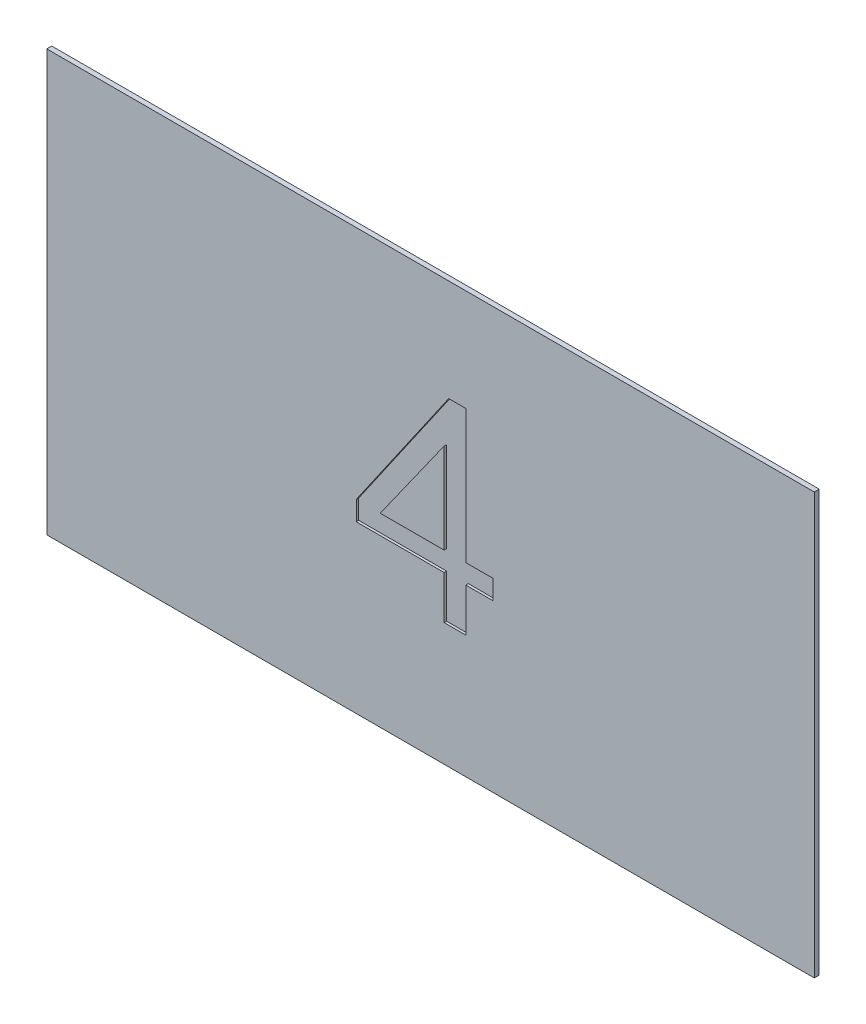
ISO-10303-21;
HEADER;
FILE_DESCRIPTION(('STEP AP214'),'2;1');
FILE_NAME('part.step','',(''),(''),'','','');
FILE_SCHEMA(('AUTOMOTIVE_DESIGN { 1 0 10303 214 1 1 1 1 }'));
ENDSEC;
DATA;
#1=APPLICATION_CONTEXT('core data for automotive mechanical design processes');
#2=APPLICATION_PROTOCOL_DEFINITION('international standard','automotive_design',2000,#1);
#3=PRODUCT_CONTEXT('',#1,'mechanical');
#4=PRODUCT('Part','Part','',(#3));
#5=PRODUCT_RELATED_PRODUCT_CATEGORY('part','',(#4));
#6=PRODUCT_DEFINITION_FORMATION('','',#4);
#7=PRODUCT_DEFINITION_CONTEXT('part definition',#1,'design');
#8=PRODUCT_DEFINITION('design','',#6,#7);
#9=PRODUCT_DEFINITION_SHAPE('','',#8);
#10=(LENGTH_UNIT() NAMED_UNIT(*) SI_UNIT(.MILLI.,.METRE.));
#11=(NAMED_UNIT(*) PLANE_ANGLE_UNIT() SI_UNIT($,.RADIAN.));
#12=(NAMED_UNIT(*) SI_UNIT($,.STERADIAN.) SOLID_ANGLE_UNIT());
#13=UNCERTAINTY_MEASURE_WITH_UNIT(LENGTH_MEASURE(1.E-05),#10,'distance_accuracy_value','');
#14=(GEOMETRIC_REPRESENTATION_CONTEXT(3) GLOBAL_UNCERTAINTY_ASSIGNED_CONTEXT((#13)) GLOBAL_UNIT_ASSIGNED_CONTEXT((#10,
#11,#12)) REPRESENTATION_CONTEXT('',''));
#15=CARTESIAN_POINT('',(0.,0.,0.));
#16=DIRECTION('',(0.,0.,1.));
#17=DIRECTION('',(1.,0.,0.));
#18=AXIS2_PLACEMENT_3D('',#15,#16,#17);
#19=CARTESIAN_POINT('',(0.,0.,0.2));
#20=DIRECTION('',(0.,0.,1.));
#21=DIRECTION('',(1.,0.,0.));
#22=AXIS2_PLACEMENT_3D('',#19,#20,#21);
#23=PLANE('',#22);
#24=DIRECTION('',(1.,0.,0.));
#25=VECTOR('',#24,1.);
#26=CARTESIAN_POINT('',(-2.03103380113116,-1.00832613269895,0.2));
#27=LINE('',#26,#25);
#28=CARTESIAN_POINT('',(0.550329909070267,-1.00832613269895,0.2));
#29=VERTEX_POINT('',#28);
#30=CARTESIAN_POINT('',(-2.03103380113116,-1.00832613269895,0.2));
#31=VERTEX_POINT('',#30);
#32=EDGE_CURVE('E139',#29,#31,#27,.F.);
#33=ORIENTED_EDGE('',*,*,#32,.F.);
#34=DIRECTION('',(0.,1.,0.));
#35=VECTOR('',#34,1.);
#36=CARTESIAN_POINT('',(0.550329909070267,-1.00832613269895,0.2));
#37=LINE('',#36,#35);
#38=CARTESIAN_POINT('',(0.550329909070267,2.63324052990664,0.2));
#39=VERTEX_POINT('',#38);
#40=EDGE_CURVE('E153',#39,#29,#37,.F.);
#41=ORIENTED_EDGE('',*,*,#40,.F.);
#42=DIRECTION('',(-0.578303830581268,-0.815821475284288,0.));
#43=VECTOR('',#42,1.);
#44=CARTESIAN_POINT('',(0.550329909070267,2.63324052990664,0.2));
#45=LINE('',#44,#43);
#46=EDGE_CURVE('E20',#31,#39,#45,.F.);
#47=ORIENTED_EDGE('',*,*,#46,.F.);
#48=EDGE_LOOP('',(#33,#41,#47));
#49=FACE_BOUND('',#48,.T.);
#50=ADVANCED_FACE('F17',(#49),#23,.T.);
#51=CARTESIAN_POINT('',(0.550329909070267,2.63324052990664,0.1));
#52=DIRECTION('',(-0.815821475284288,0.578303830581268,0.));
#53=DIRECTION('',(-0.578303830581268,-0.815821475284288,0.));
#54=AXIS2_PLACEMENT_3D('',#51,#52,#53);
#55=PLANE('',#54);
#56=DIRECTION('',(0.578303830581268,0.815821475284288,0.));
#57=VECTOR('',#56,1.);
#58=CARTESIAN_POINT('',(-2.03103380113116,-1.00832613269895,0.1));
#59=LINE('',#58,#57);
#60=CARTESIAN_POINT('',(-2.03103380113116,-1.00832613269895,0.1));
#61=VERTEX_POINT('',#60);
#62=CARTESIAN_POINT('',(0.550329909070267,2.63324052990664,0.1));
#63=VERTEX_POINT('',#62);
#64=EDGE_CURVE('E159',#61,#63,#59,.T.);
#65=ORIENTED_EDGE('',*,*,#64,.F.);
#66=DIRECTION('',(0.,0.,-1.));
#67=VECTOR('',#66,1.);
#68=CARTESIAN_POINT('',(-2.03103380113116,-1.00832613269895,0.1));
#69=LINE('',#68,#67);
#70=EDGE_CURVE('E144',#31,#61,#69,.T.);
#71=ORIENTED_EDGE('',*,*,#70,.F.);
#72=ORIENTED_EDGE('',*,*,#46,.T.);
#73=DIRECTION('',(0.,0.,-1.));
#74=VECTOR('',#73,1.);
#75=CARTESIAN_POINT('',(0.550329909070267,2.63324052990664,0.1));
#76=LINE('',#75,#74);
#77=EDGE_CURVE('E150',#63,#39,#76,.F.);
#78=ORIENTED_EDGE('',*,*,#77,.F.);
#79=EDGE_LOOP('',(#65,#71,#72,#78));
#80=FACE_BOUND('',#79,.T.);
#81=ADVANCED_FACE('F158',(#80),#55,.T.);
#82=CARTESIAN_POINT('',(0.550329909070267,-1.00832613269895,0.1));
#83=DIRECTION('',(1.,0.,0.));
#84=DIRECTION('',(0.,0.,-1.));
#85=AXIS2_PLACEMENT_3D('',#82,#83,#84);
#86=PLANE('',#85);
#87=DIRECTION('',(0.,1.,0.));
#88=VECTOR('',#87,1.);
#89=CARTESIAN_POINT('',(0.550329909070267,0.,0.1));
#90=LINE('',#89,#88);
#91=CARTESIAN_POINT('',(0.550329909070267,-1.00832613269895,0.1));
#92=VERTEX_POINT('',#91);
#93=EDGE_CURVE('E167',#63,#92,#90,.F.);
#94=ORIENTED_EDGE('',*,*,#93,.F.);
#95=ORIENTED_EDGE('',*,*,#77,.T.);
#96=ORIENTED_EDGE('',*,*,#40,.T.);
#97=DIRECTION('',(0.,0.,-1.));
#98=VECTOR('',#97,1.);
#99=CARTESIAN_POINT('',(0.550329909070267,-1.00832613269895,0.1));
#100=LINE('',#99,#98);
#101=EDGE_CURVE('E147',#92,#29,#100,.F.);
#102=ORIENTED_EDGE('',*,*,#101,.F.);
#103=EDGE_LOOP('',(#94,#95,#96,#102));
#104=FACE_BOUND('',#103,.T.);
#105=ADVANCED_FACE('F166',(#104),#86,.T.);
#106=CARTESIAN_POINT('',(-2.03103380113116,-1.00832613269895,0.1));
#107=DIRECTION('',(0.,-1.,0.));
#108=DIRECTION('',(0.,0.,-1.));
#109=AXIS2_PLACEMENT_3D('',#106,#107,#108);
#110=PLANE('',#109);
#111=DIRECTION('',(1.,0.,0.));
#112=VECTOR('',#111,1.);
#113=CARTESIAN_POINT('',(0.,-1.00832613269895,0.1));
#114=LINE('',#113,#112);
#115=EDGE_CURVE('E169',#92,#61,#114,.F.);
#116=ORIENTED_EDGE('',*,*,#115,.F.);
#117=ORIENTED_EDGE('',*,*,#101,.T.);
#118=ORIENTED_EDGE('',*,*,#32,.T.);
#119=ORIENTED_EDGE('',*,*,#70,.T.);
#120=EDGE_LOOP('',(#116,#117,#118,#119));
#121=FACE_BOUND('',#120,.T.);
#122=ADVANCED_FACE('F142',(#121),#110,.T.);
#123=CARTESIAN_POINT('',(0.,0.,0.1));
#124=DIRECTION('',(0.,0.,1.));
#125=DIRECTION('',(1.,0.,0.));
#126=AXIS2_PLACEMENT_3D('',#123,#124,#125);
#127=PLANE('',#126);
#128=DIRECTION('',(0.,1.,0.));
#129=VECTOR('',#128,1.);
#130=CARTESIAN_POINT('',(-2.9990451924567,-1.79195440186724,0.1));
#131=LINE('',#130,#129);
#132=CARTESIAN_POINT('',(-2.9990451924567,-1.79195440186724,0.1));
#133=VERTEX_POINT('',#132);
#134=CARTESIAN_POINT('',(-2.9990451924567,-1.00832613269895,0.1));
#135=VERTEX_POINT('',#134);
#136=EDGE_CURVE('E188',#133,#135,#131,.T.);
#137=ORIENTED_EDGE('',*,*,#136,.F.);
#138=DIRECTION('',(1.,0.,0.));
#139=VECTOR('',#138,1.);
#140=CARTESIAN_POINT('',(0.550329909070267,-1.79195440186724,0.1));
#141=LINE('',#140,#139);
#142=CARTESIAN_POINT('',(0.550329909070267,-1.79195440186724,0.1));
#143=VERTEX_POINT('',#142);
#144=EDGE_CURVE('E183',#143,#133,#141,.F.);
#145=ORIENTED_EDGE('',*,*,#144,.F.);
#146=DIRECTION('',(0.,1.,0.));
#147=VECTOR('',#146,1.);
#148=CARTESIAN_POINT('',(0.550329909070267,-3.54359406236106,0.1));
#149=LINE('',#148,#147);
#150=CARTESIAN_POINT('',(0.550329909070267,-3.54359406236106,0.1));
#151=VERTEX_POINT('',#150);
#152=EDGE_CURVE('E178',#151,#143,#149,.T.);
#153=ORIENTED_EDGE('',*,*,#152,.F.);
#154=DIRECTION('',(1.,0.,0.));
#155=VECTOR('',#154,1.);
#156=CARTESIAN_POINT('',(1.42614973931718,-3.54359406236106,0.1));
#157=LINE('',#156,#155);
#158=CARTESIAN_POINT('',(1.42614973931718,-3.54359406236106,0.1));
#159=VERTEX_POINT('',#158);
#160=EDGE_CURVE('E171',#159,#151,#157,.F.);
#161=ORIENTED_EDGE('',*,*,#160,.F.);
#162=DIRECTION('',(0.,1.,0.));
#163=VECTOR('',#162,1.);
#164=CARTESIAN_POINT('',(1.42614973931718,-1.79195440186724,0.1));
#165=LINE('',#164,#163);
#166=CARTESIAN_POINT('',(1.42614973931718,-1.79195440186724,0.1));
#167=VERTEX_POINT('',#166);
#168=EDGE_CURVE('E223',#167,#159,#165,.F.);
#169=ORIENTED_EDGE('',*,*,#168,.F.);
#170=DIRECTION('',(1.,0.,0.));
#171=VECTOR('',#170,1.);
#172=CARTESIAN_POINT('',(2.53244847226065,-1.79195440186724,0.1));
#173=LINE('',#172,#171);
#174=CARTESIAN_POINT('',(2.53244847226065,-1.79195440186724,0.1));
#175=VERTEX_POINT('',#174);
#176=EDGE_CURVE('E218',#175,#167,#173,.F.);
#177=ORIENTED_EDGE('',*,*,#176,.F.);
#178=DIRECTION('',(0.,1.,0.));
#179=VECTOR('',#178,1.);
#180=CARTESIAN_POINT('',(2.53244847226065,-1.00832613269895,0.1));
#181=LINE('',#180,#179);
#182=CARTESIAN_POINT('',(2.53244847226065,-1.00832613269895,0.1));
#183=VERTEX_POINT('',#182);
#184=EDGE_CURVE('E213',#183,#175,#181,.F.);
#185=ORIENTED_EDGE('',*,*,#184,.F.);
#186=DIRECTION('',(1.,0.,0.));
#187=VECTOR('',#186,1.);
#188=CARTESIAN_POINT('',(1.42614973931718,-1.00832613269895,0.1));
#189=LINE('',#188,#187);
#190=CARTESIAN_POINT('',(1.42614973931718,-1.00832613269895,0.1));
#191=VERTEX_POINT('',#190);
#192=EDGE_CURVE('E208',#191,#183,#189,.T.);
#193=ORIENTED_EDGE('',*,*,#192,.F.);
#194=DIRECTION('',(0.,1.,0.));
#195=VECTOR('',#194,1.);
#196=CARTESIAN_POINT('',(1.42614973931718,4.38488019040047,0.1));
#197=LINE('',#196,#195);
#198=CARTESIAN_POINT('',(1.42614973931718,4.38488019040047,0.1));
#199=VERTEX_POINT('',#198);
#200=EDGE_CURVE('E203',#199,#191,#197,.F.);
#201=ORIENTED_EDGE('',*,*,#200,.F.);
#202=DIRECTION('',(1.,0.,0.));
#203=VECTOR('',#202,1.);
#204=CARTESIAN_POINT('',(0.734713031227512,4.38488019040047,0.1));
#205=LINE('',#204,#203);
#206=CARTESIAN_POINT('',(0.734713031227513,4.38488019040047,0.1));
#207=VERTEX_POINT('',#206);
#208=EDGE_CURVE('E198',#207,#199,#205,.T.);
#209=ORIENTED_EDGE('',*,*,#208,.F.);
#210=DIRECTION('',(0.569209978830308,0.822192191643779,0.));
#211=VECTOR('',#210,1.);
#212=CARTESIAN_POINT('',(-2.9990451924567,-1.00832613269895,0.1));
#213=LINE('',#212,#211);
#214=EDGE_CURVE('E193',#135,#207,#213,.T.);
#215=ORIENTED_EDGE('',*,*,#214,.F.);
#216=EDGE_LOOP('',(#137,#145,#153,#161,#169,#177,#185,#193,#201,#209,#215));
#217=FACE_BOUND('',#216,.T.);
#218=ORIENTED_EDGE('',*,*,#93,.T.);
#219=ORIENTED_EDGE('',*,*,#115,.T.);
#220=ORIENTED_EDGE('',*,*,#64,.T.);
#221=EDGE_LOOP('',(#218,#219,#220));
#222=FACE_BOUND('',#221,.T.);
#223=ADVANCED_FACE('F351',(#217,#222),#127,.T.);
#224=CARTESIAN_POINT('',(1.42614973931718,-3.54359406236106,0.1));
#225=DIRECTION('',(0.,1.,0.));
#226=DIRECTION('',(0.,0.,1.));
#227=AXIS2_PLACEMENT_3D('',#224,#225,#226);
#228=PLANE('',#227);
#229=ORIENTED_EDGE('',*,*,#160,.T.);
#230=DIRECTION('',(0.,0.,-1.));
#231=VECTOR('',#230,1.);
#232=CARTESIAN_POINT('',(0.550329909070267,-3.54359406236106,0.1));
#233=LINE('',#232,#231);
#234=CARTESIAN_POINT('',(0.550329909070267,-3.54359406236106,0.2));
#235=VERTEX_POINT('',#234);
#236=EDGE_CURVE('E175',#235,#151,#233,.T.);
#237=ORIENTED_EDGE('',*,*,#236,.F.);
#238=DIRECTION('',(1.,0.,0.));
#239=VECTOR('',#238,1.);
#240=CARTESIAN_POINT('',(0.,-3.54359406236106,0.2));
#241=LINE('',#240,#239);
#242=CARTESIAN_POINT('',(1.42614973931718,-3.54359406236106,0.2));
#243=VERTEX_POINT('',#242);
#244=EDGE_CURVE('E227',#243,#235,#241,.F.);
#245=ORIENTED_EDGE('',*,*,#244,.F.);
#246=DIRECTION('',(0.,0.,1.));
#247=VECTOR('',#246,1.);
#248=CARTESIAN_POINT('',(1.42614973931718,-3.54359406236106,0.1));
#249=LINE('',#248,#247);
#250=EDGE_CURVE('E225',#159,#243,#249,.T.);
#251=ORIENTED_EDGE('',*,*,#250,.F.);
#252=EDGE_LOOP('',(#229,#237,#245,#251));
#253=FACE_BOUND('',#252,.T.);
#254=ADVANCED_FACE('F347',(#253),#228,.T.);
#255=CARTESIAN_POINT('',(0.550329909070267,-3.54359406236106,0.1));
#256=DIRECTION('',(1.,0.,0.));
#257=DIRECTION('',(0.,0.,-1.));
#258=AXIS2_PLACEMENT_3D('',#255,#256,#257);
#259=PLANE('',#258);
#260=ORIENTED_EDGE('',*,*,#152,.T.);
#261=DIRECTION('',(0.,0.,1.));
#262=VECTOR('',#261,1.);
#263=CARTESIAN_POINT('',(0.550329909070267,-1.79195440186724,0.1));
#264=LINE('',#263,#262);
#265=CARTESIAN_POINT('',(0.550329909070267,-1.79195440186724,0.2));
#266=VERTEX_POINT('',#265);
#267=EDGE_CURVE('E180',#266,#143,#264,.F.);
#268=ORIENTED_EDGE('',*,*,#267,.F.);
#269=DIRECTION('',(0.,1.,0.));
#270=VECTOR('',#269,1.);
#271=CARTESIAN_POINT('',(0.550329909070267,0.,0.2));
#272=LINE('',#271,#270);
#273=EDGE_CURVE('E229',#235,#266,#272,.T.);
#274=ORIENTED_EDGE('',*,*,#273,.F.);
#275=ORIENTED_EDGE('',*,*,#236,.T.);
#276=EDGE_LOOP('',(#260,#268,#274,#275));
#277=FACE_BOUND('',#276,.T.);
#278=ADVANCED_FACE('F343',(#277),#259,.T.);
#279=CARTESIAN_POINT('',(0.550329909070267,-1.79195440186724,0.1));
#280=DIRECTION('',(0.,1.,0.));
#281=DIRECTION('',(0.,0.,1.));
#282=AXIS2_PLACEMENT_3D('',#279,#280,#281);
#283=PLANE('',#282);
#284=ORIENTED_EDGE('',*,*,#144,.T.);
#285=DIRECTION('',(0.,0.,-1.));
#286=VECTOR('',#285,1.);
#287=CARTESIAN_POINT('',(-2.9990451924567,-1.79195440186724,0.1));
#288=LINE('',#287,#286);
#289=CARTESIAN_POINT('',(-2.9990451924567,-1.79195440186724,0.2));
#290=VERTEX_POINT('',#289);
#291=EDGE_CURVE('E185',#290,#133,#288,.T.);
#292=ORIENTED_EDGE('',*,*,#291,.F.);
#293=DIRECTION('',(1.,0.,0.));
#294=VECTOR('',#293,1.);
#295=CARTESIAN_POINT('',(0.,-1.79195440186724,0.2));
#296=LINE('',#295,#294);
#297=EDGE_CURVE('E231',#266,#290,#296,.F.);
#298=ORIENTED_EDGE('',*,*,#297,.F.);
#299=ORIENTED_EDGE('',*,*,#267,.T.);
#300=EDGE_LOOP('',(#284,#292,#298,#299));
#301=FACE_BOUND('',#300,.T.);
#302=ADVANCED_FACE('F339',(#301),#283,.T.);
#303=CARTESIAN_POINT('',(-2.9990451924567,-1.79195440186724,0.1));
#304=DIRECTION('',(1.,0.,0.));
#305=DIRECTION('',(0.,0.,-1.));
#306=AXIS2_PLACEMENT_3D('',#303,#304,#305);
#307=PLANE('',#306);
#308=ORIENTED_EDGE('',*,*,#136,.T.);
#309=DIRECTION('',(0.,0.,1.));
#310=VECTOR('',#309,1.);
#311=CARTESIAN_POINT('',(-2.9990451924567,-1.00832613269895,0.1));
#312=LINE('',#311,#310);
#313=CARTESIAN_POINT('',(-2.9990451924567,-1.00832613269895,0.2));
#314=VERTEX_POINT('',#313);
#315=EDGE_CURVE('E190',#314,#135,#312,.F.);
#316=ORIENTED_EDGE('',*,*,#315,.F.);
#317=DIRECTION('',(0.,1.,0.));
#318=VECTOR('',#317,1.);
#319=CARTESIAN_POINT('',(-2.9990451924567,0.,0.2));
#320=LINE('',#319,#318);
#321=EDGE_CURVE('E233',#290,#314,#320,.T.);
#322=ORIENTED_EDGE('',*,*,#321,.F.);
#323=ORIENTED_EDGE('',*,*,#291,.T.);
#324=EDGE_LOOP('',(#308,#316,#322,#323));
#325=FACE_BOUND('',#324,.T.);
#326=ADVANCED_FACE('F335',(#325),#307,.T.);
#327=CARTESIAN_POINT('',(-2.9990451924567,-1.00832613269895,0.1));
#328=DIRECTION('',(0.822192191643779,-0.569209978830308,0.));
#329=DIRECTION('',(0.569209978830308,0.822192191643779,0.));
#330=AXIS2_PLACEMENT_3D('',#327,#328,#329);
#331=PLANE('',#330);
#332=ORIENTED_EDGE('',*,*,#214,.T.);
#333=DIRECTION('',(0.,0.,-1.));
#334=VECTOR('',#333,1.);
#335=CARTESIAN_POINT('',(0.734713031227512,4.38488019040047,0.1));
#336=LINE('',#335,#334);
#337=CARTESIAN_POINT('',(0.734713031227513,4.38488019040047,0.2));
#338=VERTEX_POINT('',#337);
#339=EDGE_CURVE('E195',#338,#207,#336,.T.);
#340=ORIENTED_EDGE('',*,*,#339,.F.);
#341=DIRECTION('',(0.569209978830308,0.822192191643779,0.));
#342=VECTOR('',#341,1.);
#343=CARTESIAN_POINT('',(-2.9990451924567,-1.00832613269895,0.2));
#344=LINE('',#343,#342);
#345=EDGE_CURVE('E235',#314,#338,#344,.T.);
#346=ORIENTED_EDGE('',*,*,#345,.F.);
#347=ORIENTED_EDGE('',*,*,#315,.T.);
#348=EDGE_LOOP('',(#332,#340,#346,#347));
#349=FACE_BOUND('',#348,.T.);
#350=ADVANCED_FACE('F331',(#349),#331,.T.);
#351=CARTESIAN_POINT('',(0.734713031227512,4.38488019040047,0.1));
#352=DIRECTION('',(0.,-1.,0.));
#353=DIRECTION('',(0.,0.,-1.));
#354=AXIS2_PLACEMENT_3D('',#351,#352,#353);
#355=PLANE('',#354);
#356=ORIENTED_EDGE('',*,*,#208,.T.);
#357=DIRECTION('',(0.,0.,1.));
#358=VECTOR('',#357,1.);
#359=CARTESIAN_POINT('',(1.42614973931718,4.38488019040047,0.1));
#360=LINE('',#359,#358);
#361=CARTESIAN_POINT('',(1.42614973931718,4.38488019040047,0.2));
#362=VERTEX_POINT('',#361);
#363=EDGE_CURVE('E200',#362,#199,#360,.F.);
#364=ORIENTED_EDGE('',*,*,#363,.F.);
#365=DIRECTION('',(1.,0.,0.));
#366=VECTOR('',#365,1.);
#367=CARTESIAN_POINT('',(0.,4.38488019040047,0.2));
#368=LINE('',#367,#366);
#369=EDGE_CURVE('E237',#338,#362,#368,.T.);
#370=ORIENTED_EDGE('',*,*,#369,.F.);
#371=ORIENTED_EDGE('',*,*,#339,.T.);
#372=EDGE_LOOP('',(#356,#364,#370,#371));
#373=FACE_BOUND('',#372,.T.);
#374=ADVANCED_FACE('F327',(#373),#355,.T.);
#375=CARTESIAN_POINT('',(1.42614973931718,4.38488019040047,0.1));
#376=DIRECTION('',(-1.,0.,0.));
#377=DIRECTION('',(0.,0.,1.));
#378=AXIS2_PLACEMENT_3D('',#375,#376,#377);
#379=PLANE('',#378);
#380=ORIENTED_EDGE('',*,*,#200,.T.);
#381=DIRECTION('',(0.,0.,-1.));
#382=VECTOR('',#381,1.);
#383=CARTESIAN_POINT('',(1.42614973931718,-1.00832613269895,0.1));
#384=LINE('',#383,#382);
#385=CARTESIAN_POINT('',(1.42614973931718,-1.00832613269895,0.2));
#386=VERTEX_POINT('',#385);
#387=EDGE_CURVE('E205',#386,#191,#384,.T.);
#388=ORIENTED_EDGE('',*,*,#387,.F.);
#389=DIRECTION('',(0.,1.,0.));
#390=VECTOR('',#389,1.);
#391=CARTESIAN_POINT('',(1.42614973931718,0.,0.2));
#392=LINE('',#391,#390);
#393=EDGE_CURVE('E239',#362,#386,#392,.F.);
#394=ORIENTED_EDGE('',*,*,#393,.F.);
#395=ORIENTED_EDGE('',*,*,#363,.T.);
#396=EDGE_LOOP('',(#380,#388,#394,#395));
#397=FACE_BOUND('',#396,.T.);
#398=ADVANCED_FACE('F323',(#397),#379,.T.);
#399=CARTESIAN_POINT('',(1.42614973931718,-1.00832613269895,0.1));
#400=DIRECTION('',(0.,-1.,0.));
#401=DIRECTION('',(0.,0.,-1.));
#402=AXIS2_PLACEMENT_3D('',#399,#400,#401);
#403=PLANE('',#402);
#404=ORIENTED_EDGE('',*,*,#192,.T.);
#405=DIRECTION('',(0.,0.,1.));
#406=VECTOR('',#405,1.);
#407=CARTESIAN_POINT('',(2.53244847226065,-1.00832613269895,0.1));
#408=LINE('',#407,#406);
#409=CARTESIAN_POINT('',(2.53244847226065,-1.00832613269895,0.2));
#410=VERTEX_POINT('',#409);
#411=EDGE_CURVE('E210',#410,#183,#408,.F.);
#412=ORIENTED_EDGE('',*,*,#411,.F.);
#413=DIRECTION('',(1.,0.,0.));
#414=VECTOR('',#413,1.);
#415=CARTESIAN_POINT('',(0.,-1.00832613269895,0.2));
#416=LINE('',#415,#414);
#417=EDGE_CURVE('E241',#386,#410,#416,.T.);
#418=ORIENTED_EDGE('',*,*,#417,.F.);
#419=ORIENTED_EDGE('',*,*,#387,.T.);
#420=EDGE_LOOP('',(#404,#412,#418,#419));
#421=FACE_BOUND('',#420,.T.);
#422=ADVANCED_FACE('F319',(#421),#403,.T.);
#423=CARTESIAN_POINT('',(2.53244847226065,-1.00832613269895,0.1));
#424=DIRECTION('',(-1.,0.,0.));
#425=DIRECTION('',(0.,0.,1.));
#426=AXIS2_PLACEMENT_3D('',#423,#424,#425);
#427=PLANE('',#426);
#428=ORIENTED_EDGE('',*,*,#184,.T.);
#429=DIRECTION('',(0.,0.,1.));
#430=VECTOR('',#429,1.);
#431=CARTESIAN_POINT('',(2.53244847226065,-1.79195440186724,0.1));
#432=LINE('',#431,#430);
#433=CARTESIAN_POINT('',(2.53244847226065,-1.79195440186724,0.2));
#434=VERTEX_POINT('',#433);
#435=EDGE_CURVE('E215',#434,#175,#432,.F.);
#436=ORIENTED_EDGE('',*,*,#435,.F.);
#437=DIRECTION('',(0.,1.,0.));
#438=VECTOR('',#437,1.);
#439=CARTESIAN_POINT('',(2.53244847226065,0.,0.2));
#440=LINE('',#439,#438);
#441=EDGE_CURVE('E243',#410,#434,#440,.F.);
#442=ORIENTED_EDGE('',*,*,#441,.F.);
#443=ORIENTED_EDGE('',*,*,#411,.T.);
#444=EDGE_LOOP('',(#428,#436,#442,#443));
#445=FACE_BOUND('',#444,.T.);
#446=ADVANCED_FACE('F315',(#445),#427,.T.);
#447=CARTESIAN_POINT('',(2.53244847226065,-1.79195440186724,0.1));
#448=DIRECTION('',(0.,1.,0.));
#449=DIRECTION('',(0.,0.,1.));
#450=AXIS2_PLACEMENT_3D('',#447,#448,#449);
#451=PLANE('',#450);
#452=ORIENTED_EDGE('',*,*,#176,.T.);
#453=DIRECTION('',(0.,0.,1.));
#454=VECTOR('',#453,1.);
#455=CARTESIAN_POINT('',(1.42614973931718,-1.79195440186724,0.1));
#456=LINE('',#455,#454);
#457=CARTESIAN_POINT('',(1.42614973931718,-1.79195440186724,0.2));
#458=VERTEX_POINT('',#457);
#459=EDGE_CURVE('E220',#458,#167,#456,.F.);
#460=ORIENTED_EDGE('',*,*,#459,.F.);
#461=DIRECTION('',(1.,0.,0.));
#462=VECTOR('',#461,1.);
#463=CARTESIAN_POINT('',(0.,-1.79195440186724,0.2));
#464=LINE('',#463,#462);
#465=EDGE_CURVE('E245',#434,#458,#464,.F.);
#466=ORIENTED_EDGE('',*,*,#465,.F.);
#467=ORIENTED_EDGE('',*,*,#435,.T.);
#468=EDGE_LOOP('',(#452,#460,#466,#467));
#469=FACE_BOUND('',#468,.T.);
#470=ADVANCED_FACE('F311',(#469),#451,.T.);
#471=CARTESIAN_POINT('',(1.42614973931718,-1.79195440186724,0.1));
#472=DIRECTION('',(-1.,0.,0.));
#473=DIRECTION('',(0.,0.,1.));
#474=AXIS2_PLACEMENT_3D('',#471,#472,#473);
#475=PLANE('',#474);
#476=ORIENTED_EDGE('',*,*,#168,.T.);
#477=ORIENTED_EDGE('',*,*,#250,.T.);
#478=DIRECTION('',(0.,1.,0.));
#479=VECTOR('',#478,1.);
#480=CARTESIAN_POINT('',(1.42614973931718,0.,0.2));
#481=LINE('',#480,#479);
#482=EDGE_CURVE('E247',#458,#243,#481,.F.);
#483=ORIENTED_EDGE('',*,*,#482,.F.);
#484=ORIENTED_EDGE('',*,*,#459,.T.);
#485=EDGE_LOOP('',(#476,#477,#483,#484));
#486=FACE_BOUND('',#485,.T.);
#487=ADVANCED_FACE('F307',(#486),#475,.T.);
#488=CARTESIAN_POINT('',(0.,0.,0.2));
#489=DIRECTION('',(0.,0.,1.));
#490=DIRECTION('',(1.,0.,0.));
#491=AXIS2_PLACEMENT_3D('',#488,#489,#490);
#492=PLANE('',#491);
#493=ORIENTED_EDGE('',*,*,#465,.T.);
#494=ORIENTED_EDGE('',*,*,#482,.T.);
#495=ORIENTED_EDGE('',*,*,#244,.T.);
#496=ORIENTED_EDGE('',*,*,#273,.T.);
#497=ORIENTED_EDGE('',*,*,#297,.T.);
#498=ORIENTED_EDGE('',*,*,#321,.T.);
#499=ORIENTED_EDGE('',*,*,#345,.T.);
#500=ORIENTED_EDGE('',*,*,#369,.T.);
#501=ORIENTED_EDGE('',*,*,#393,.T.);
#502=ORIENTED_EDGE('',*,*,#417,.T.);
#503=ORIENTED_EDGE('',*,*,#441,.T.);
#504=EDGE_LOOP('',(#493,#494,#495,#496,#497,#498,#499,#500,#501,#502,#503));
#505=FACE_BOUND('',#504,.T.);
#506=DIRECTION('',(0.,1.,0.));
#507=VECTOR('',#506,1.);
#508=CARTESIAN_POINT('',(-15.5,8.5,0.2));
#509=LINE('',#508,#507);
#510=CARTESIAN_POINT('',(-15.5,8.5,0.2));
#511=VERTEX_POINT('',#510);
#512=CARTESIAN_POINT('',(-15.5,-8.5,0.2));
#513=VERTEX_POINT('',#512);
#514=EDGE_CURVE('E255',#511,#513,#509,.F.);
#515=ORIENTED_EDGE('',*,*,#514,.T.);
#516=DIRECTION('',(1.,0.,0.));
#517=VECTOR('',#516,1.);
#518=CARTESIAN_POINT('',(-15.5,-8.5,0.2));
#519=LINE('',#518,#517);
#520=CARTESIAN_POINT('',(15.5,-8.5,0.2));
#521=VERTEX_POINT('',#520);
#522=EDGE_CURVE('E260',#513,#521,#519,.T.);
#523=ORIENTED_EDGE('',*,*,#522,.T.);
#524=DIRECTION('',(0.,-1.,0.));
#525=VECTOR('',#524,1.);
#526=CARTESIAN_POINT('',(15.5,8.5,0.2));
#527=LINE('',#526,#525);
#528=CARTESIAN_POINT('',(15.5,8.5,0.2));
#529=VERTEX_POINT('',#528);
#530=EDGE_CURVE('E263',#521,#529,#527,.F.);
#531=ORIENTED_EDGE('',*,*,#530,.T.);
#532=DIRECTION('',(1.,0.,0.));
#533=VECTOR('',#532,1.);
#534=CARTESIAN_POINT('',(-15.5,8.5,0.2));
#535=LINE('',#534,#533);
#536=EDGE_CURVE('E250',#529,#511,#535,.F.);
#537=ORIENTED_EDGE('',*,*,#536,.T.);
#538=EDGE_LOOP('',(#515,#523,#531,#537));
#539=FACE_BOUND('',#538,.T.);
#540=ADVANCED_FACE('F304',(#505,#539),#492,.T.);
#541=CARTESIAN_POINT('',(-15.5,8.5,0.2));
#542=DIRECTION('',(0.,-1.,0.));
#543=DIRECTION('',(0.,0.,-1.));
#544=AXIS2_PLACEMENT_3D('',#541,#542,#543);
#545=PLANE('',#544);
#546=DIRECTION('',(0.,0.,-1.));
#547=VECTOR('',#546,1.);
#548=CARTESIAN_POINT('',(-15.5,8.5,0.2));
#549=LINE('',#548,#547);
#550=CARTESIAN_POINT('',(-15.5,8.5,0.));
#551=VERTEX_POINT('',#550);
#552=EDGE_CURVE('E252',#551,#511,#549,.F.);
#553=ORIENTED_EDGE('',*,*,#552,.T.);
#554=ORIENTED_EDGE('',*,*,#536,.F.);
#555=DIRECTION('',(0.,0.,1.));
#556=VECTOR('',#555,1.);
#557=CARTESIAN_POINT('',(15.5,8.5,0.2));
#558=LINE('',#557,#556);
#559=CARTESIAN_POINT('',(15.5,8.5,0.));
#560=VERTEX_POINT('',#559);
#561=EDGE_CURVE('E266',#529,#560,#558,.F.);
#562=ORIENTED_EDGE('',*,*,#561,.T.);
#563=DIRECTION('',(1.,0.,0.));
#564=VECTOR('',#563,1.);
#565=CARTESIAN_POINT('',(0.,8.5,0.));
#566=LINE('',#565,#564);
#567=EDGE_CURVE('E269',#560,#551,#566,.F.);
#568=ORIENTED_EDGE('',*,*,#567,.T.);
#569=EDGE_LOOP('',(#553,#554,#562,#568));
#570=FACE_BOUND('',#569,.T.);
#571=ADVANCED_FACE('F287',(#570),#545,.F.);
#572=CARTESIAN_POINT('',(-15.5,8.5,0.2));
#573=DIRECTION('',(1.,0.,0.));
#574=DIRECTION('',(0.,0.,-1.));
#575=AXIS2_PLACEMENT_3D('',#572,#573,#574);
#576=PLANE('',#575);
#577=DIRECTION('',(0.,0.,1.));
#578=VECTOR('',#577,1.);
#579=CARTESIAN_POINT('',(-15.5,-8.5,0.2));
#580=LINE('',#579,#578);
#581=CARTESIAN_POINT('',(-15.5,-8.5,0.));
#582=VERTEX_POINT('',#581);
#583=EDGE_CURVE('E257',#582,#513,#580,.T.);
#584=ORIENTED_EDGE('',*,*,#583,.T.);
#585=ORIENTED_EDGE('',*,*,#514,.F.);
#586=ORIENTED_EDGE('',*,*,#552,.F.);
#587=DIRECTION('',(0.,1.,0.));
#588=VECTOR('',#587,1.);
#589=CARTESIAN_POINT('',(-15.5,0.,0.));
#590=LINE('',#589,#588);
#591=EDGE_CURVE('E272',#551,#582,#590,.F.);
#592=ORIENTED_EDGE('',*,*,#591,.T.);
#593=EDGE_LOOP('',(#584,#585,#586,#592));
#594=FACE_BOUND('',#593,.T.);
#595=ADVANCED_FACE('F284',(#594),#576,.F.);
#596=CARTESIAN_POINT('',(-15.5,-8.5,0.2));
#597=DIRECTION('',(0.,1.,0.));
#598=DIRECTION('',(0.,0.,1.));
#599=AXIS2_PLACEMENT_3D('',#596,#597,#598);
#600=PLANE('',#599);
#601=DIRECTION('',(0.,0.,1.));
#602=VECTOR('',#601,1.);
#603=CARTESIAN_POINT('',(15.5,-8.5,0.2));
#604=LINE('',#603,#602);
#605=CARTESIAN_POINT('',(15.5,-8.5,0.));
#606=VERTEX_POINT('',#605);
#607=EDGE_CURVE('E34',#606,#521,#604,.T.);
#608=ORIENTED_EDGE('',*,*,#607,.T.);
#609=ORIENTED_EDGE('',*,*,#522,.F.);
#610=ORIENTED_EDGE('',*,*,#583,.F.);
#611=DIRECTION('',(1.,0.,0.));
#612=VECTOR('',#611,1.);
#613=CARTESIAN_POINT('',(0.,-8.5,0.));
#614=LINE('',#613,#612);
#615=EDGE_CURVE('E26',#582,#606,#614,.T.);
#616=ORIENTED_EDGE('',*,*,#615,.T.);
#617=EDGE_LOOP('',(#608,#609,#610,#616));
#618=FACE_BOUND('',#617,.T.);
#619=ADVANCED_FACE('F278',(#618),#600,.F.);
#620=CARTESIAN_POINT('',(15.5,8.5,0.2));
#621=DIRECTION('',(-1.,0.,0.));
#622=DIRECTION('',(0.,-1.,0.));
#623=AXIS2_PLACEMENT_3D('',#620,#621,#622);
#624=PLANE('',#623);
#625=ORIENTED_EDGE('',*,*,#561,.F.);
#626=ORIENTED_EDGE('',*,*,#530,.F.);
#627=ORIENTED_EDGE('',*,*,#607,.F.);
#628=DIRECTION('',(0.,1.,0.));
#629=VECTOR('',#628,1.);
#630=CARTESIAN_POINT('',(15.5,0.,0.));
#631=LINE('',#630,#629);
#632=EDGE_CURVE('E11',#606,#560,#631,.T.);
#633=ORIENTED_EDGE('',*,*,#632,.T.);
#634=EDGE_LOOP('',(#625,#626,#627,#633));
#635=FACE_BOUND('',#634,.T.);
#636=ADVANCED_FACE('F289',(#635),#624,.F.);
#637=CARTESIAN_POINT('',(0.,0.,0.));
#638=DIRECTION('',(0.,0.,1.));
#639=DIRECTION('',(1.,0.,0.));
#640=AXIS2_PLACEMENT_3D('',#637,#638,#639);
#641=PLANE('',#640);
#642=ORIENTED_EDGE('',*,*,#615,.F.);
#643=ORIENTED_EDGE('',*,*,#591,.F.);
#644=ORIENTED_EDGE('',*,*,#567,.F.);
#645=ORIENTED_EDGE('',*,*,#632,.F.);
#646=EDGE_LOOP('',(#642,#643,#644,#645));
#647=FACE_BOUND('',#646,.T.);
#648=ADVANCED_FACE('F282',(#647),#641,.F.);
#649=CLOSED_SHELL('',(#50,#81,#105,#122,#223,#254,#278,#302,#326,#350,#374,#398,#422,#446,#470,
#487,#540,#571,#595,#619,#636,#648));
#650=MANIFOLD_SOLID_BREP('B1',#649);
#651=ADVANCED_BREP_SHAPE_REPRESENTATION('',(#18,#650),#14);
#652=SHAPE_DEFINITION_REPRESENTATION(#9,#651);
ENDSEC;
END-ISO-10303-21;
